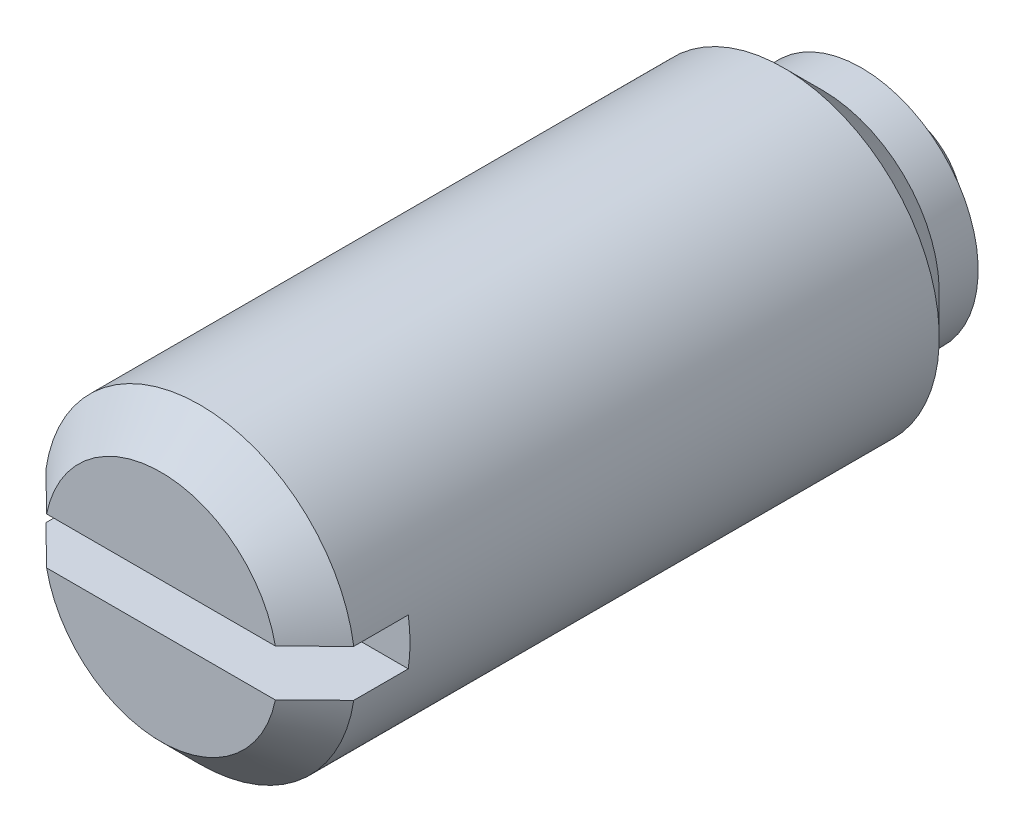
ISO-10303-21;
HEADER;
FILE_DESCRIPTION(('STEP AP214'),'2;1');
FILE_NAME('part.step','',(''),(''),'','','');
FILE_SCHEMA(('AUTOMOTIVE_DESIGN { 1 0 10303 214 1 1 1 1 }'));
ENDSEC;
DATA;
#1=APPLICATION_CONTEXT('core data for automotive mechanical design processes');
#2=APPLICATION_PROTOCOL_DEFINITION('international standard','automotive_design',2000,#1);
#3=PRODUCT_CONTEXT('',#1,'mechanical');
#4=PRODUCT('Part','Part','',(#3));
#5=PRODUCT_RELATED_PRODUCT_CATEGORY('part','',(#4));
#6=PRODUCT_DEFINITION_FORMATION('','',#4);
#7=PRODUCT_DEFINITION_CONTEXT('part definition',#1,'design');
#8=PRODUCT_DEFINITION('design','',#6,#7);
#9=PRODUCT_DEFINITION_SHAPE('','',#8);
#10=(LENGTH_UNIT() NAMED_UNIT(*) SI_UNIT(.MILLI.,.METRE.));
#11=(NAMED_UNIT(*) PLANE_ANGLE_UNIT() SI_UNIT($,.RADIAN.));
#12=(NAMED_UNIT(*) SI_UNIT($,.STERADIAN.) SOLID_ANGLE_UNIT());
#13=UNCERTAINTY_MEASURE_WITH_UNIT(LENGTH_MEASURE(1.E-05),#10,'distance_accuracy_value','');
#14=(GEOMETRIC_REPRESENTATION_CONTEXT(3) GLOBAL_UNCERTAINTY_ASSIGNED_CONTEXT((#13)) GLOBAL_UNIT_ASSIGNED_CONTEXT((#10,
#11,#12)) REPRESENTATION_CONTEXT('',''));
#15=CARTESIAN_POINT('',(0.,0.,0.));
#16=DIRECTION('',(0.,0.,1.));
#17=DIRECTION('',(1.,0.,0.));
#18=AXIS2_PLACEMENT_3D('',#15,#16,#17);
#19=CARTESIAN_POINT('',(0.,2.,9.8));
#20=DIRECTION('',(0.,0.,1.));
#21=DIRECTION('',(1.,0.,0.));
#22=AXIS2_PLACEMENT_3D('',#19,#20,#21);
#23=PLANE('',#22);
#24=CARTESIAN_POINT('',(0.,0.,9.8));
#25=DIRECTION('',(0.,0.,-1.));
#26=DIRECTION('',(0.,1.,0.));
#27=AXIS2_PLACEMENT_3D('',#24,#25,#26);
#28=CIRCLE('',#27,1.5);
#29=CARTESIAN_POINT('',(-1.46969384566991,0.3,9.8));
#30=VERTEX_POINT('',#29);
#31=CARTESIAN_POINT('',(1.46969384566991,0.3,9.8));
#32=VERTEX_POINT('',#31);
#33=EDGE_CURVE('E30',#30,#32,#28,.T.);
#34=ORIENTED_EDGE('',*,*,#33,.F.);
#35=DIRECTION('',(1.,0.,0.));
#36=VECTOR('',#35,1.);
#37=CARTESIAN_POINT('',(-1.97737199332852,0.3,9.8));
#38=LINE('',#37,#36);
#39=EDGE_CURVE('E149',#30,#32,#38,.T.);
#40=ORIENTED_EDGE('',*,*,#39,.T.);
#41=EDGE_LOOP('',(#34,#40));
#42=FACE_BOUND('',#41,.T.);
#43=ADVANCED_FACE('F14',(#42),#23,.T.);
#44=CARTESIAN_POINT('',(0.,0.,-10.2));
#45=DIRECTION('',(0.,0.,-1.));
#46=DIRECTION('',(-1.,0.,0.));
#47=AXIS2_PLACEMENT_3D('',#44,#45,#46);
#48=CYLINDRICAL_SURFACE('',#47,2.);
#49=CARTESIAN_POINT('',(0.,0.,9.3));
#50=DIRECTION('',(0.,0.,-1.));
#51=DIRECTION('',(0.,1.,0.));
#52=AXIS2_PLACEMENT_3D('',#49,#50,#51);
#53=CIRCLE('',#52,2.);
#54=CARTESIAN_POINT('',(1.97737199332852,-0.3,9.3));
#55=VERTEX_POINT('',#54);
#56=CARTESIAN_POINT('',(-1.97737199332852,-0.3,9.3));
#57=VERTEX_POINT('',#56);
#58=EDGE_CURVE('E38',#55,#57,#53,.T.);
#59=ORIENTED_EDGE('',*,*,#58,.T.);
#60=DIRECTION('',(0.,0.,1.));
#61=VECTOR('',#60,1.);
#62=CARTESIAN_POINT('',(-1.97737199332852,-0.3,8.6));
#63=LINE('',#62,#61);
#64=CARTESIAN_POINT('',(-1.97737199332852,-0.3,8.6));
#65=VERTEX_POINT('',#64);
#66=EDGE_CURVE('E96',#65,#57,#63,.T.);
#67=ORIENTED_EDGE('',*,*,#66,.F.);
#68=CARTESIAN_POINT('',(0.,0.,8.6));
#69=DIRECTION('',(0.,0.,1.));
#70=DIRECTION('',(1.,0.,0.));
#71=AXIS2_PLACEMENT_3D('',#68,#69,#70);
#72=CIRCLE('',#71,2.);
#73=CARTESIAN_POINT('',(-1.97737199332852,0.3,8.6));
#74=VERTEX_POINT('',#73);
#75=EDGE_CURVE('E150',#74,#65,#72,.T.);
#76=ORIENTED_EDGE('',*,*,#75,.F.);
#77=DIRECTION('',(0.,0.,1.));
#78=VECTOR('',#77,1.);
#79=CARTESIAN_POINT('',(-1.97737199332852,0.3,8.6));
#80=LINE('',#79,#78);
#81=CARTESIAN_POINT('',(-1.97737199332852,0.3,9.3));
#82=VERTEX_POINT('',#81);
#83=EDGE_CURVE('E85',#74,#82,#80,.T.);
#84=ORIENTED_EDGE('',*,*,#83,.T.);
#85=CARTESIAN_POINT('',(1.97737199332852,0.3,9.3));
#86=VERTEX_POINT('',#85);
#87=EDGE_CURVE('E68',#82,#86,#53,.T.);
#88=ORIENTED_EDGE('',*,*,#87,.T.);
#89=DIRECTION('',(0.,0.,1.));
#90=VECTOR('',#89,1.);
#91=CARTESIAN_POINT('',(1.97737199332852,0.3,8.6));
#92=LINE('',#91,#90);
#93=CARTESIAN_POINT('',(1.97737199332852,0.3,8.6));
#94=VERTEX_POINT('',#93);
#95=EDGE_CURVE('E83',#94,#86,#92,.T.);
#96=ORIENTED_EDGE('',*,*,#95,.F.);
#97=CARTESIAN_POINT('',(1.97737199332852,-0.3,8.6));
#98=VERTEX_POINT('',#97);
#99=EDGE_CURVE('E153',#98,#94,#72,.T.);
#100=ORIENTED_EDGE('',*,*,#99,.F.);
#101=DIRECTION('',(0.,0.,1.));
#102=VECTOR('',#101,1.);
#103=CARTESIAN_POINT('',(1.97737199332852,-0.3,8.6));
#104=LINE('',#103,#102);
#105=EDGE_CURVE('E91',#98,#55,#104,.T.);
#106=ORIENTED_EDGE('',*,*,#105,.T.);
#107=EDGE_LOOP('',(#59,#67,#76,#84,#88,#96,#100,#106));
#108=FACE_BOUND('',#107,.T.);
#109=CARTESIAN_POINT('',(0.,0.,1.8));
#110=DIRECTION('',(0.,0.,-1.));
#111=DIRECTION('',(-1.,0.,0.));
#112=AXIS2_PLACEMENT_3D('',#109,#110,#111);
#113=CIRCLE('',#112,2.);
#114=CARTESIAN_POINT('',(-2.,0.,1.8));
#115=VERTEX_POINT('',#114);
#116=EDGE_CURVE('E167',#115,#115,#113,.T.);
#117=ORIENTED_EDGE('',*,*,#116,.F.);
#118=EDGE_LOOP('',(#117));
#119=FACE_BOUND('',#118,.T.);
#120=ADVANCED_FACE('F80',(#108,#119),#48,.T.);
#121=CARTESIAN_POINT('',(1.46969384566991,-0.3,9.8));
#122=VERTEX_POINT('',#121);
#123=CARTESIAN_POINT('',(-1.46969384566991,-0.3,9.8));
#124=VERTEX_POINT('',#123);
#125=EDGE_CURVE('E75',#122,#124,#28,.T.);
#126=ORIENTED_EDGE('',*,*,#125,.F.);
#127=DIRECTION('',(1.,0.,0.));
#128=VECTOR('',#127,1.);
#129=CARTESIAN_POINT('',(-1.97737199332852,-0.3,9.8));
#130=LINE('',#129,#128);
#131=EDGE_CURVE('E126',#124,#122,#130,.T.);
#132=ORIENTED_EDGE('',*,*,#131,.F.);
#133=EDGE_LOOP('',(#126,#132));
#134=FACE_BOUND('',#133,.T.);
#135=ADVANCED_FACE('F131',(#134),#23,.T.);
#136=CARTESIAN_POINT('',(-1.97737199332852,0.3,8.6));
#137=DIRECTION('',(0.,-1.,0.));
#138=DIRECTION('',(1.,0.,0.));
#139=AXIS2_PLACEMENT_3D('',#136,#137,#138);
#140=PLANE('',#139);
#141=CARTESIAN_POINT('',(-4.36930776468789,0.3,6.92040523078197));
#142=CARTESIAN_POINT('',(-4.2182047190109,0.3,7.071150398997));
#143=CARTESIAN_POINT('',(-4.06708609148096,0.3,7.22187996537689));
#144=CARTESIAN_POINT('',(-3.76479359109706,0.3,7.52329098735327));
#145=CARTESIAN_POINT('',(-3.61361971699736,0.3,7.67397244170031));
#146=CARTESIAN_POINT('',(-3.311116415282,0.3,7.97534626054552));
#147=CARTESIAN_POINT('',(-3.15978694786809,0.3,8.12603858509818));
#148=CARTESIAN_POINT('',(-2.85702233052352,0.3,8.42730995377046));
#149=CARTESIAN_POINT('',(-2.70558718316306,0.3,8.57788900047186));
#150=CARTESIAN_POINT('',(-2.40212774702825,0.3,8.87927600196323));
#151=CARTESIAN_POINT('',(-2.25010297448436,0.3,9.03008346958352));
#152=CARTESIAN_POINT('',(-1.94573383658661,0.3,9.33139714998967));
#153=CARTESIAN_POINT('',(-1.79338944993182,0.3,9.48190334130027));
#154=CARTESIAN_POINT('',(-1.56441129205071,0.3,9.70714049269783));
#155=CARTESIAN_POINT('',(-1.4880216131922,0.3,9.782119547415));
#156=CARTESIAN_POINT('',(-1.33498337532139,0.3,9.93181788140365));
#157=CARTESIAN_POINT('',(-1.25833480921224,0.3,10.0065371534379));
#158=CARTESIAN_POINT('',(-1.10461869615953,0.3,10.155523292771));
#159=CARTESIAN_POINT('',(-1.02755120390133,0.3,10.2297902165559));
#160=CARTESIAN_POINT('',(-0.872656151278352,0.3,10.3775261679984));
#161=CARTESIAN_POINT('',(-0.794828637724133,0.3,10.4509952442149));
#162=CARTESIAN_POINT('',(-0.694739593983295,0.3,10.5432970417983));
#163=CARTESIAN_POINT('',(-0.673262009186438,0.3,10.562977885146));
#164=CARTESIAN_POINT('',(-0.630136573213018,0.3,10.6021535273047));
#165=CARTESIAN_POINT('',(-0.608488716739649,0.3,10.6216483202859));
#166=CARTESIAN_POINT('',(-0.56495293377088,0.3,10.6604118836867));
#167=CARTESIAN_POINT('',(-0.543064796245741,0.3,10.6796804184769));
#168=CARTESIAN_POINT('',(-0.49899251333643,0.3,10.7178706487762));
#169=CARTESIAN_POINT('',(-0.476808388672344,0.3,10.7367923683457));
#170=CARTESIAN_POINT('',(-0.417956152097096,0.3,10.7859272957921));
#171=CARTESIAN_POINT('',(-0.380956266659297,0.3,10.8157550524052));
#172=CARTESIAN_POINT('',(-0.324022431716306,0.3,10.858594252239));
#173=CARTESIAN_POINT('',(-0.304807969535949,0.3,10.8725552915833));
#174=CARTESIAN_POINT('',(-0.265710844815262,0.3,10.8995004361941));
#175=CARTESIAN_POINT('',(-0.245828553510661,0.3,10.9124850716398));
#176=CARTESIAN_POINT('',(-0.205606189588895,0.3,10.9366532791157));
#177=CARTESIAN_POINT('',(-0.185287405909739,0.3,10.9478716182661));
#178=CARTESIAN_POINT('',(-0.143496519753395,0.3,10.9679508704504));
#179=CARTESIAN_POINT('',(-0.122026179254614,0.3,10.9768152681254));
#180=CARTESIAN_POINT('',(-0.0825482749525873,0.3,10.9892843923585));
#181=CARTESIAN_POINT('',(-0.0647771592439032,0.3,10.9936072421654));
#182=CARTESIAN_POINT('',(-0.0287767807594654,0.3,10.9991429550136));
#183=CARTESIAN_POINT('',(-0.0105489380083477,0.3,11.0003644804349));
#184=CARTESIAN_POINT('',(0.0258463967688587,0.3,10.9994405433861));
#185=CARTESIAN_POINT('',(0.0440137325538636,0.3,10.9972893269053));
#186=CARTESIAN_POINT('',(0.0797711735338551,0.3,10.9900748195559));
#187=CARTESIAN_POINT('',(0.0973597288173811,0.3,10.9850042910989));
#188=CARTESIAN_POINT('',(0.134659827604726,0.3,10.971703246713));
#189=CARTESIAN_POINT('',(0.154227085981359,0.3,10.9630832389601));
#190=CARTESIAN_POINT('',(0.192439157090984,0.3,10.9439683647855));
#191=CARTESIAN_POINT('',(0.211081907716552,0.3,10.9334695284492));
#192=CARTESIAN_POINT('',(0.247789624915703,0.3,10.911174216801));
#193=CARTESIAN_POINT('',(0.265847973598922,0.3,10.8993670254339));
#194=CARTESIAN_POINT('',(0.301381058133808,0.3,10.8749521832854));
#195=CARTESIAN_POINT('',(0.318856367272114,0.3,10.8623453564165));
#196=CARTESIAN_POINT('',(0.374311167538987,0.3,10.8209889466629));
#197=CARTESIAN_POINT('',(0.411493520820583,0.3,10.7911785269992));
#198=CARTESIAN_POINT('',(0.484780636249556,0.3,10.7302541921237));
#199=CARTESIAN_POINT('',(0.520884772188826,0.3,10.6991395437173));
#200=CARTESIAN_POINT('',(0.592489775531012,0.3,10.6361063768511));
#201=CARTESIAN_POINT('',(0.627989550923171,0.3,10.6041866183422));
#202=CARTESIAN_POINT('',(0.698552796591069,0.3,10.5398894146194));
#203=CARTESIAN_POINT('',(0.733616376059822,0.3,10.5075120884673));
#204=CARTESIAN_POINT('',(0.838040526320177,0.3,10.4102465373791));
#205=CARTESIAN_POINT('',(0.90698356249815,0.3,10.3449107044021));
#206=CARTESIAN_POINT('',(1.04423296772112,0.3,10.2137059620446));
#207=CARTESIAN_POINT('',(1.1125398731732,0.3,10.1478376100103));
#208=CARTESIAN_POINT('',(1.31478976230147,0.3,9.95183558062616));
#209=CARTESIAN_POINT('',(1.44826100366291,0.3,9.82121543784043));
#210=CARTESIAN_POINT('',(1.71467860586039,0.3,9.55943882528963));
#211=CARTESIAN_POINT('',(1.84762495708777,0.3,9.42828234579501));
#212=CARTESIAN_POINT('',(2.11328983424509,0.3,9.16561655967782));
#213=CARTESIAN_POINT('',(2.24600822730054,0.3,9.03410711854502));
#214=CARTESIAN_POINT('',(2.51127663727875,0.3,8.77092058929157));
#215=CARTESIAN_POINT('',(2.64382665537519,0.3,8.63924350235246));
#216=CARTESIAN_POINT('',(3.042168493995,0.3,8.24321178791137));
#217=CARTESIAN_POINT('',(3.30780264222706,0.3,7.97869856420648));
#218=CARTESIAN_POINT('',(3.70604308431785,0.3,7.5818493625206));
#219=CARTESIAN_POINT('',(3.83872179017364,0.3,7.44958597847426));
#220=CARTESIAN_POINT('',(4.10404087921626,0.3,7.18502144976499));
#221=CARTESIAN_POINT('',(4.23668126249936,0.3,7.05272030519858));
#222=CARTESIAN_POINT('',(4.36930776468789,0.3,6.92040523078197));
#223=B_SPLINE_CURVE_WITH_KNOTS('',3,(#141,#142,#143,#144,#145,#146,#147,#148,#149,#150,#151,
#152,#153,#154,#155,#156,#157,#158,#159,#160,#161,#162,#163,#164,#165,#166,#167,#168,#169,#170,
#171,#172,#173,#174,#175,#176,#177,#178,#179,#180,#181,#182,#183,#184,#185,#186,#187,#188,#189,
#190,#191,#192,#193,#194,#195,#196,#197,#198,#199,#200,#201,#202,#203,#204,#205,#206,#207,#208,
#209,#210,#211,#212,#213,#214,#215,#216,#217,#218,#219,#220,#221,#222),.UNSPECIFIED.,.F.,.F.,(4,
2,2,2,2,2,2,2,2,2,2,2,2,2,2,2,2,2,2,2,2,2,2,2,2,2,2,2,2,2,2,2,2,2,2,2,2,2,2,2,4),(0.,
0.64031722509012,1.28064990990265,1.92133628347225,2.56200758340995,3.2044168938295,
3.8468704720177,4.16798577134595,4.48910994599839,4.81019316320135,5.13125672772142,
5.21864916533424,5.30604433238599,5.39352362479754,5.48099682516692,5.62350177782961,
5.69473650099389,5.76593226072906,5.83547798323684,5.90492017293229,5.9595720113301,
6.01407103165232,6.0686631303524,6.12339116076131,6.18737857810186,6.25150283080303,
6.31619771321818,6.38082698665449,6.52372170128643,6.66669785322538,6.80990958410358,
6.95308471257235,7.23802661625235,7.52270131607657,8.08295076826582,8.64321042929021,
9.20372771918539,9.76424108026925,10.8888556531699,11.4508833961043,12.0129097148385),.UNSPECIFIED.);
#224=EDGE_CURVE('E74',#82,#30,#223,.T.);
#225=ORIENTED_EDGE('',*,*,#224,.F.);
#226=ORIENTED_EDGE('',*,*,#83,.F.);
#227=DIRECTION('',(1.,0.,0.));
#228=VECTOR('',#227,1.);
#229=CARTESIAN_POINT('',(-1.97737199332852,0.3,8.6));
#230=LINE('',#229,#228);
#231=EDGE_CURVE('E90',#74,#94,#230,.T.);
#232=ORIENTED_EDGE('',*,*,#231,.T.);
#233=ORIENTED_EDGE('',*,*,#95,.T.);
#234=EDGE_CURVE('E65',#32,#86,#223,.T.);
#235=ORIENTED_EDGE('',*,*,#234,.F.);
#236=ORIENTED_EDGE('',*,*,#39,.F.);
#237=EDGE_LOOP('',(#225,#226,#232,#233,#235,#236));
#238=FACE_BOUND('',#237,.T.);
#239=ADVANCED_FACE('F88',(#238),#140,.T.);
#240=CARTESIAN_POINT('',(-1.97737199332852,-0.3,8.6));
#241=DIRECTION('',(0.,-1.,0.));
#242=DIRECTION('',(1.,0.,0.));
#243=AXIS2_PLACEMENT_3D('',#240,#241,#242);
#244=PLANE('',#243);
#245=ORIENTED_EDGE('',*,*,#66,.T.);
#246=CARTESIAN_POINT('',(-4.36930776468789,-0.3,6.92040523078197));
#247=CARTESIAN_POINT('',(-4.2182047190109,-0.3,7.071150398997));
#248=CARTESIAN_POINT('',(-4.06708609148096,-0.3,7.22187996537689));
#249=CARTESIAN_POINT('',(-3.76479359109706,-0.3,7.52329098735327));
#250=CARTESIAN_POINT('',(-3.61361971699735,-0.3,7.67397244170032));
#251=CARTESIAN_POINT('',(-3.31111641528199,-0.3,7.97534626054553));
#252=CARTESIAN_POINT('',(-3.15978694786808,-0.3,8.12603858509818));
#253=CARTESIAN_POINT('',(-2.85702233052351,-0.3,8.42730995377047));
#254=CARTESIAN_POINT('',(-2.70558718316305,-0.3,8.57788900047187));
#255=CARTESIAN_POINT('',(-2.40212774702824,-0.3,8.87927600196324));
#256=CARTESIAN_POINT('',(-2.25010297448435,-0.3,9.03008346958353));
#257=CARTESIAN_POINT('',(-1.94573383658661,-0.3,9.33139714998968));
#258=CARTESIAN_POINT('',(-1.79338944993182,-0.3,9.48190334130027));
#259=CARTESIAN_POINT('',(-1.56441129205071,-0.3,9.70714049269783));
#260=CARTESIAN_POINT('',(-1.48802161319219,-0.3,9.782119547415));
#261=CARTESIAN_POINT('',(-1.33498337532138,-0.3,9.93181788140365));
#262=CARTESIAN_POINT('',(-1.25833480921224,-0.3,10.0065371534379));
#263=CARTESIAN_POINT('',(-1.10461869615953,-0.3,10.155523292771));
#264=CARTESIAN_POINT('',(-1.02755120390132,-0.3,10.2297902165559));
#265=CARTESIAN_POINT('',(-0.872656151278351,-0.3,10.3775261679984));
#266=CARTESIAN_POINT('',(-0.794828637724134,-0.3,10.4509952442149));
#267=CARTESIAN_POINT('',(-0.694739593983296,-0.3,10.5432970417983));
#268=CARTESIAN_POINT('',(-0.673262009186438,-0.3,10.562977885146));
#269=CARTESIAN_POINT('',(-0.630136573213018,-0.3,10.6021535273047));
#270=CARTESIAN_POINT('',(-0.60848871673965,-0.3,10.6216483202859));
#271=CARTESIAN_POINT('',(-0.56495293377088,-0.3,10.6604118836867));
#272=CARTESIAN_POINT('',(-0.543064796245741,-0.3,10.6796804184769));
#273=CARTESIAN_POINT('',(-0.498992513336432,-0.3,10.7178706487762));
#274=CARTESIAN_POINT('',(-0.476808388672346,-0.3,10.7367923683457));
#275=CARTESIAN_POINT('',(-0.417956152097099,-0.3,10.7859272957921));
#276=CARTESIAN_POINT('',(-0.380956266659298,-0.3,10.8157550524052));
#277=CARTESIAN_POINT('',(-0.324022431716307,-0.3,10.858594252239));
#278=CARTESIAN_POINT('',(-0.30480796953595,-0.3,10.8725552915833));
#279=CARTESIAN_POINT('',(-0.265710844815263,-0.3,10.8995004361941));
#280=CARTESIAN_POINT('',(-0.245828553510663,-0.3,10.9124850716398));
#281=CARTESIAN_POINT('',(-0.205606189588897,-0.3,10.9366532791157));
#282=CARTESIAN_POINT('',(-0.185287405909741,-0.3,10.9478716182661));
#283=CARTESIAN_POINT('',(-0.143496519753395,-0.3,10.9679508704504));
#284=CARTESIAN_POINT('',(-0.122026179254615,-0.3,10.9768152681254));
#285=CARTESIAN_POINT('',(-0.0825482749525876,-0.3,10.9892843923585));
#286=CARTESIAN_POINT('',(-0.0647771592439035,-0.3,10.9936072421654));
#287=CARTESIAN_POINT('',(-0.0287767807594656,-0.3,10.9991429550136));
#288=CARTESIAN_POINT('',(-0.0105489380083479,-0.3,11.0003644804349));
#289=CARTESIAN_POINT('',(0.0258463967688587,-0.3,10.9994405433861));
#290=CARTESIAN_POINT('',(0.0440137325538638,-0.3,10.9972893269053));
#291=CARTESIAN_POINT('',(0.0797711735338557,-0.3,10.9900748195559));
#292=CARTESIAN_POINT('',(0.0973597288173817,-0.3,10.9850042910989));
#293=CARTESIAN_POINT('',(0.134659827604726,-0.3,10.971703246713));
#294=CARTESIAN_POINT('',(0.154227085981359,-0.3,10.9630832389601));
#295=CARTESIAN_POINT('',(0.192439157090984,-0.3,10.9439683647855));
#296=CARTESIAN_POINT('',(0.211081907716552,-0.3,10.9334695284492));
#297=CARTESIAN_POINT('',(0.247789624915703,-0.3,10.911174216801));
#298=CARTESIAN_POINT('',(0.265847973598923,-0.3,10.8993670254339));
#299=CARTESIAN_POINT('',(0.301381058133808,-0.3,10.8749521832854));
#300=CARTESIAN_POINT('',(0.318856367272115,-0.3,10.8623453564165));
#301=CARTESIAN_POINT('',(0.374311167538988,-0.3,10.8209889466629));
#302=CARTESIAN_POINT('',(0.411493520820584,-0.3,10.7911785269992));
#303=CARTESIAN_POINT('',(0.484780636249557,-0.3,10.7302541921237));
#304=CARTESIAN_POINT('',(0.520884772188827,-0.3,10.6991395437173));
#305=CARTESIAN_POINT('',(0.592489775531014,-0.3,10.6361063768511));
#306=CARTESIAN_POINT('',(0.627989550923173,-0.3,10.6041866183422));
#307=CARTESIAN_POINT('',(0.698552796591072,-0.3,10.5398894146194));
#308=CARTESIAN_POINT('',(0.733616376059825,-0.3,10.5075120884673));
#309=CARTESIAN_POINT('',(0.83804052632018,-0.3,10.4102465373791));
#310=CARTESIAN_POINT('',(0.906983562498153,-0.3,10.3449107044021));
#311=CARTESIAN_POINT('',(1.04423296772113,-0.3,10.2137059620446));
#312=CARTESIAN_POINT('',(1.1125398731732,-0.3,10.1478376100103));
#313=CARTESIAN_POINT('',(1.31478976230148,-0.3,9.95183558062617));
#314=CARTESIAN_POINT('',(1.44826100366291,-0.3,9.82121543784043));
#315=CARTESIAN_POINT('',(1.71467860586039,-0.3,9.55943882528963));
#316=CARTESIAN_POINT('',(1.84762495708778,-0.3,9.42828234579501));
#317=CARTESIAN_POINT('',(2.11328983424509,-0.3,9.16561655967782));
#318=CARTESIAN_POINT('',(2.24600822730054,-0.3,9.03410711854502));
#319=CARTESIAN_POINT('',(2.51127663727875,-0.3,8.77092058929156));
#320=CARTESIAN_POINT('',(2.64382665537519,-0.3,8.63924350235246));
#321=CARTESIAN_POINT('',(3.042168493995,-0.3,8.24321178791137));
#322=CARTESIAN_POINT('',(3.30780264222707,-0.3,7.97869856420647));
#323=CARTESIAN_POINT('',(3.70604308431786,-0.3,7.58184936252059));
#324=CARTESIAN_POINT('',(3.83872179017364,-0.3,7.44958597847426));
#325=CARTESIAN_POINT('',(4.10404087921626,-0.3,7.18502144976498));
#326=CARTESIAN_POINT('',(4.23668126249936,-0.3,7.05272030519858));
#327=CARTESIAN_POINT('',(4.36930776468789,-0.3,6.92040523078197));
#328=B_SPLINE_CURVE_WITH_KNOTS('',3,(#246,#247,#248,#249,#250,#251,#252,#253,#254,#255,#256,
#257,#258,#259,#260,#261,#262,#263,#264,#265,#266,#267,#268,#269,#270,#271,#272,#273,#274,#275,
#276,#277,#278,#279,#280,#281,#282,#283,#284,#285,#286,#287,#288,#289,#290,#291,#292,#293,#294,
#295,#296,#297,#298,#299,#300,#301,#302,#303,#304,#305,#306,#307,#308,#309,#310,#311,#312,#313,
#314,#315,#316,#317,#318,#319,#320,#321,#322,#323,#324,#325,#326,#327),.UNSPECIFIED.,.F.,.F.,(4,
2,2,2,2,2,2,2,2,2,2,2,2,2,2,2,2,2,2,2,2,2,2,2,2,2,2,2,2,2,2,2,2,2,2,2,2,2,2,2,4),(0.,
0.640317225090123,1.28064990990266,1.92133628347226,2.56200758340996,3.20441689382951,
3.84687047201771,4.16798577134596,4.48910994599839,4.81019316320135,5.13125672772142,
5.21864916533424,5.30604433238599,5.39352362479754,5.48099682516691,5.62350177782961,
5.69473650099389,5.76593226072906,5.83547798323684,5.90492017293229,5.9595720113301,
6.01407103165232,6.0686631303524,6.12339116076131,6.18737857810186,6.25150283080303,
6.31619771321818,6.38082698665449,6.52372170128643,6.66669785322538,6.80990958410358,
6.95308471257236,7.23802661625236,7.52270131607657,8.08295076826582,8.64321042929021,
9.20372771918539,9.76424108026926,10.8888556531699,11.4508833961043,12.0129097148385),.UNSPECIFIED.);
#329=EDGE_CURVE('E9',#57,#124,#328,.T.);
#330=ORIENTED_EDGE('',*,*,#329,.T.);
#331=ORIENTED_EDGE('',*,*,#131,.T.);
#332=EDGE_CURVE('E23',#122,#55,#328,.T.);
#333=ORIENTED_EDGE('',*,*,#332,.T.);
#334=ORIENTED_EDGE('',*,*,#105,.F.);
#335=DIRECTION('',(1.,0.,0.));
#336=VECTOR('',#335,1.);
#337=CARTESIAN_POINT('',(-1.97737199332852,-0.3,8.6));
#338=LINE('',#337,#336);
#339=EDGE_CURVE('E151',#65,#98,#338,.T.);
#340=ORIENTED_EDGE('',*,*,#339,.F.);
#341=EDGE_LOOP('',(#245,#330,#331,#333,#334,#340));
#342=FACE_BOUND('',#341,.T.);
#343=ADVANCED_FACE('F107',(#342),#244,.F.);
#344=CARTESIAN_POINT('',(0.,0.,8.6));
#345=DIRECTION('',(0.,0.,1.));
#346=DIRECTION('',(1.,0.,0.));
#347=AXIS2_PLACEMENT_3D('',#344,#345,#346);
#348=PLANE('',#347);
#349=ORIENTED_EDGE('',*,*,#75,.T.);
#350=ORIENTED_EDGE('',*,*,#339,.T.);
#351=ORIENTED_EDGE('',*,*,#99,.T.);
#352=ORIENTED_EDGE('',*,*,#231,.F.);
#353=EDGE_LOOP('',(#349,#350,#351,#352));
#354=FACE_BOUND('',#353,.T.);
#355=ADVANCED_FACE('F118',(#354),#348,.T.);
#356=CARTESIAN_POINT('',(0.,0.,9.8));
#357=DIRECTION('',(0.,0.,-1.));
#358=DIRECTION('',(0.,1.,0.));
#359=AXIS2_PLACEMENT_3D('',#356,#357,#358);
#360=CONICAL_SURFACE('',#359,1.5,0.785398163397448);
#361=ORIENTED_EDGE('',*,*,#58,.F.);
#362=ORIENTED_EDGE('',*,*,#332,.F.);
#363=ORIENTED_EDGE('',*,*,#125,.T.);
#364=ORIENTED_EDGE('',*,*,#329,.F.);
#365=EDGE_LOOP('',(#361,#362,#363,#364));
#366=FACE_BOUND('',#365,.T.);
#367=ADVANCED_FACE('F115',(#366),#360,.T.);
#368=ORIENTED_EDGE('',*,*,#224,.T.);
#369=ORIENTED_EDGE('',*,*,#33,.T.);
#370=ORIENTED_EDGE('',*,*,#234,.T.);
#371=ORIENTED_EDGE('',*,*,#87,.F.);
#372=EDGE_LOOP('',(#368,#369,#370,#371));
#373=FACE_BOUND('',#372,.T.);
#374=ADVANCED_FACE('F67',(#373),#360,.T.);
#375=CARTESIAN_POINT('',(0.,0.,1.3));
#376=DIRECTION('',(0.,0.,1.));
#377=DIRECTION('',(1.,0.,0.));
#378=AXIS2_PLACEMENT_3D('',#375,#376,#377);
#379=CONICAL_SURFACE('',#378,1.5,0.785398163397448);
#380=ORIENTED_EDGE('',*,*,#116,.T.);
#381=EDGE_LOOP('',(#380));
#382=FACE_BOUND('',#381,.T.);
#383=CARTESIAN_POINT('',(0.,0.,1.3));
#384=DIRECTION('',(0.,0.,-1.));
#385=DIRECTION('',(-1.,0.,0.));
#386=AXIS2_PLACEMENT_3D('',#383,#384,#385);
#387=CIRCLE('',#386,1.5);
#388=CARTESIAN_POINT('',(-1.5,0.,1.3));
#389=VERTEX_POINT('',#388);
#390=EDGE_CURVE('E164',#389,#389,#387,.T.);
#391=ORIENTED_EDGE('',*,*,#390,.F.);
#392=EDGE_LOOP('',(#391));
#393=FACE_BOUND('',#392,.T.);
#394=ADVANCED_FACE('F114',(#382,#393),#379,.T.);
#395=CARTESIAN_POINT('',(0.,0.,1.25));
#396=DIRECTION('',(-1.,0.,0.));
#397=DIRECTION('',(0.,0.,1.));
#398=AXIS2_PLACEMENT_3D('',#395,#396,#397);
#399=SPHERICAL_SURFACE('',#398,1.25);
#400=CARTESIAN_POINT('',(0.,0.,1.25));
#401=DIRECTION('',(0.,0.,-1.));
#402=DIRECTION('',(-1.,0.,0.));
#403=AXIS2_PLACEMENT_3D('',#400,#401,#402);
#404=SPHERICAL_SURFACE('',#403,1.25);
#405=CARTESIAN_POINT('',(0.,0.,0.8));
#406=DIRECTION('',(0.,0.,-1.));
#407=DIRECTION('',(-1.,0.,0.));
#408=AXIS2_PLACEMENT_3D('',#405,#406,#407);
#409=CIRCLE('',#408,1.16619037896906);
#410=CARTESIAN_POINT('',(-1.16619037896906,0.,0.8));
#411=VERTEX_POINT('',#410);
#412=EDGE_CURVE('E93',#411,#411,#409,.T.);
#413=ORIENTED_EDGE('',*,*,#412,.T.);
#414=EDGE_LOOP('',(#413));
#415=FACE_BOUND('',#414,.T.);
#416=ADVANCED_FACE('F16',(#415),#404,.T.);
#417=CARTESIAN_POINT('',(0.,1.16619037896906,0.8));
#418=DIRECTION('',(0.,0.,-1.));
#419=DIRECTION('',(-1.,0.,0.));
#420=AXIS2_PLACEMENT_3D('',#417,#418,#419);
#421=PLANE('',#420);
#422=CARTESIAN_POINT('',(0.,0.,0.8));
#423=DIRECTION('',(0.,0.,-1.));
#424=DIRECTION('',(0.,1.,0.));
#425=AXIS2_PLACEMENT_3D('',#422,#423,#424);
#426=CIRCLE('',#425,1.5);
#427=CARTESIAN_POINT('',(0.,1.5,0.8));
#428=VERTEX_POINT('',#427);
#429=EDGE_CURVE('E18',#428,#428,#426,.F.);
#430=ORIENTED_EDGE('',*,*,#429,.F.);
#431=EDGE_LOOP('',(#430));
#432=FACE_BOUND('',#431,.T.);
#433=ORIENTED_EDGE('',*,*,#412,.F.);
#434=EDGE_LOOP('',(#433));
#435=FACE_BOUND('',#434,.T.);
#436=ADVANCED_FACE('F132',(#432,#435),#421,.T.);
#437=CARTESIAN_POINT('',(0.,0.,-1.12822354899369));
#438=DIRECTION('',(0.,0.,-1.));
#439=DIRECTION('',(0.,1.,0.));
#440=AXIS2_PLACEMENT_3D('',#437,#438,#439);
#441=CYLINDRICAL_SURFACE('',#440,1.5);
#442=ORIENTED_EDGE('',*,*,#390,.T.);
#443=EDGE_LOOP('',(#442));
#444=FACE_BOUND('',#443,.T.);
#445=ORIENTED_EDGE('',*,*,#429,.T.);
#446=EDGE_LOOP('',(#445));
#447=FACE_BOUND('',#446,.T.);
#448=ADVANCED_FACE('F116',(#444,#447),#441,.T.);
#449=CLOSED_SHELL('',(#43,#120,#135,#239,#343,#355,#367,#374,#394,#416,#436,#448));
#450=MANIFOLD_SOLID_BREP('B1',#449);
#451=ADVANCED_BREP_SHAPE_REPRESENTATION('',(#18,#450),#14);
#452=SHAPE_DEFINITION_REPRESENTATION(#9,#451);
ENDSEC;
END-ISO-10303-21;
